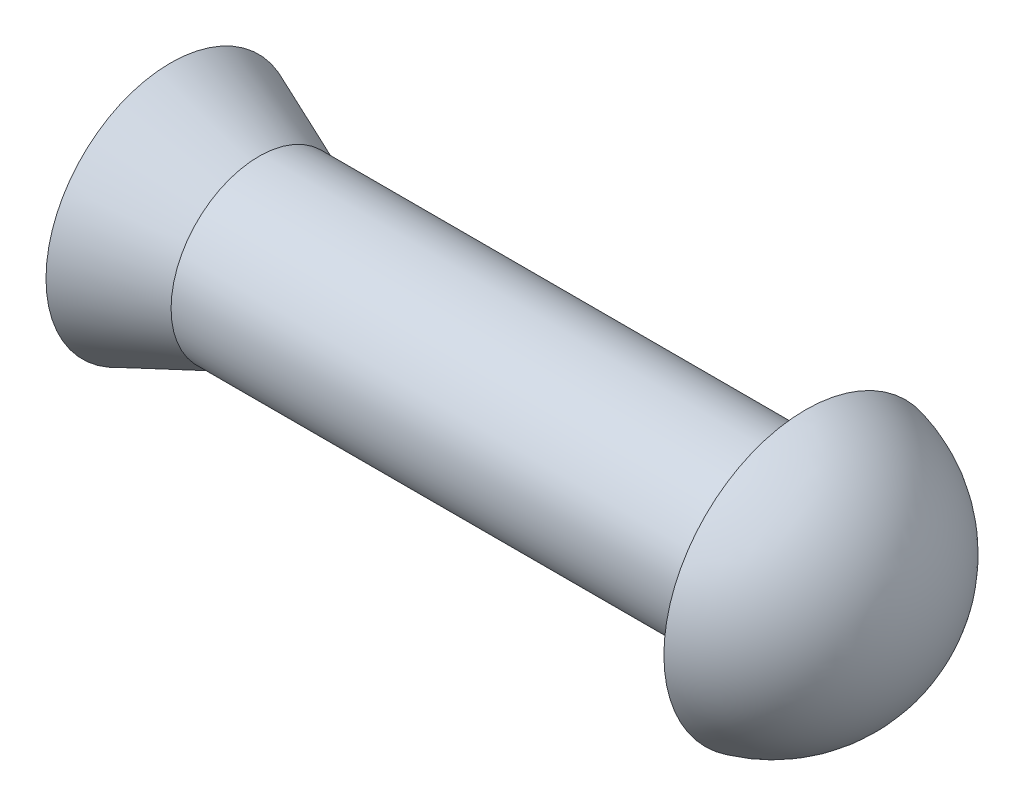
from build123d import *


with BuildPart() as part:
    # Sketch1 → Base-Revolve (revolve)
    with BuildSketch(Plane.XY, mode=Mode.PRIVATE) as base_revolve_sk:
        with BuildLine():
            Line((-131.923380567, 0), (0, 0))
            Line((0, 0), (0, 18))
            Line((0, 18), (-111.893398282, 18))
            Line((-111.893398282, 18), (-130, 25.5))
            ThreePointArc((-130, 25.5), (-131.44185346, 12.786217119), (-131.923380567, 0))
        make_face()
    revolve(base_revolve_sk.sketch.rotate(Axis((-39, 0, 0), (1, 0, 0)), 90), axis=Axis((-39, 0, 0), (1, 0, 0)))

    # Sketch2 → HeadTypeA (revolve)
    with BuildSketch(Plane.XY):
        with BuildLine():
            Line((0, 0), (23, 0))
            ThreePointArc((23, 0), (16.551996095, 18.506755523), (0, 29))
            Line((0, 29), (0, 0))
        make_face()
    revolve(axis=Axis((-49, 0, 0), (1, 0, 0)))


solid = part.part
